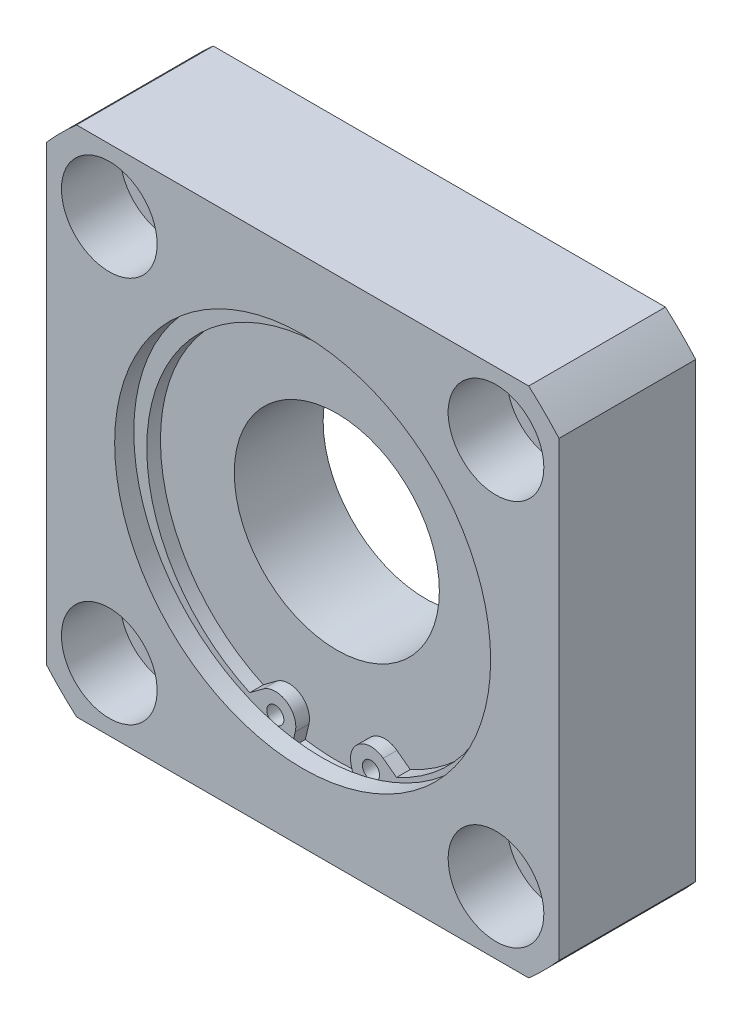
ISO-10303-21;
HEADER;
FILE_DESCRIPTION(('STEP AP214'),'2;1');
FILE_NAME('part.step','',(''),(''),'','','');
FILE_SCHEMA(('AUTOMOTIVE_DESIGN { 1 0 10303 214 1 1 1 1 }'));
ENDSEC;
DATA;
#1=APPLICATION_CONTEXT('core data for automotive mechanical design processes');
#2=APPLICATION_PROTOCOL_DEFINITION('international standard','automotive_design',2000,#1);
#3=PRODUCT_CONTEXT('',#1,'mechanical');
#4=PRODUCT('Part','Part','',(#3));
#5=PRODUCT_RELATED_PRODUCT_CATEGORY('part','',(#4));
#6=PRODUCT_DEFINITION_FORMATION('','',#4);
#7=PRODUCT_DEFINITION_CONTEXT('part definition',#1,'design');
#8=PRODUCT_DEFINITION('design','',#6,#7);
#9=PRODUCT_DEFINITION_SHAPE('','',#8);
#10=(LENGTH_UNIT() NAMED_UNIT(*) SI_UNIT(.MILLI.,.METRE.));
#11=(NAMED_UNIT(*) PLANE_ANGLE_UNIT() SI_UNIT($,.RADIAN.));
#12=(NAMED_UNIT(*) SI_UNIT($,.STERADIAN.) SOLID_ANGLE_UNIT());
#13=UNCERTAINTY_MEASURE_WITH_UNIT(LENGTH_MEASURE(1.E-05),#10,'distance_accuracy_value','');
#14=(GEOMETRIC_REPRESENTATION_CONTEXT(3) GLOBAL_UNCERTAINTY_ASSIGNED_CONTEXT((#13)) GLOBAL_UNIT_ASSIGNED_CONTEXT((#10,
#11,#12)) REPRESENTATION_CONTEXT('',''));
#15=CARTESIAN_POINT('',(0.,0.,0.));
#16=DIRECTION('',(0.,0.,1.));
#17=DIRECTION('',(1.,0.,0.));
#18=AXIS2_PLACEMENT_3D('',#15,#16,#17);
#19=CARTESIAN_POINT('',(0.,0.,15.));
#20=DIRECTION('',(0.,0.,1.));
#21=DIRECTION('',(1.,0.,0.));
#22=AXIS2_PLACEMENT_3D('',#19,#20,#21);
#23=PLANE('',#22);
#24=CARTESIAN_POINT('',(7.,-25.7166112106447,15.));
#25=DIRECTION('',(0.,0.,1.));
#26=DIRECTION('',(1.,0.,0.));
#27=AXIS2_PLACEMENT_3D('',#24,#25,#26);
#28=CIRCLE('',#27,1.25);
#29=CARTESIAN_POINT('',(8.25,-25.7166112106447,15.));
#30=VERTEX_POINT('',#29);
#31=EDGE_CURVE('E449',#30,#30,#28,.T.);
#32=ORIENTED_EDGE('',*,*,#31,.T.);
#33=EDGE_LOOP('',(#32));
#34=FACE_BOUND('',#33,.T.);
#35=ADVANCED_FACE('F14',(#34),#23,.T.);
#36=CARTESIAN_POINT('',(-7.,-25.7166112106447,15.));
#37=DIRECTION('',(0.,0.,-1.));
#38=DIRECTION('',(1.,0.,0.));
#39=AXIS2_PLACEMENT_3D('',#36,#37,#38);
#40=CIRCLE('',#39,1.25);
#41=CARTESIAN_POINT('',(-5.75,-25.7166112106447,15.));
#42=VERTEX_POINT('',#41);
#43=EDGE_CURVE('E193',#42,#42,#40,.T.);
#44=ORIENTED_EDGE('',*,*,#43,.F.);
#45=EDGE_LOOP('',(#44));
#46=FACE_BOUND('',#45,.T.);
#47=ADVANCED_FACE('F378',(#46),#23,.T.);
#48=CARTESIAN_POINT('',(28.2842712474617,28.2842712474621,11.4));
#49=DIRECTION('',(0.,0.,1.));
#50=DIRECTION('',(1.,0.,0.));
#51=AXIS2_PLACEMENT_3D('',#48,#49,#50);
#52=PLANE('',#51);
#53=CARTESIAN_POINT('',(28.2842712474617,28.2842712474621,11.4));
#54=DIRECTION('',(0.,0.,1.));
#55=DIRECTION('',(1.,0.,0.));
#56=AXIS2_PLACEMENT_3D('',#53,#54,#55);
#57=CIRCLE('',#56,7.);
#58=CARTESIAN_POINT('',(35.2842712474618,28.2842712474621,11.4));
#59=VERTEX_POINT('',#58);
#60=EDGE_CURVE('E275',#59,#59,#57,.T.);
#61=ORIENTED_EDGE('',*,*,#60,.T.);
#62=EDGE_LOOP('',(#61));
#63=FACE_BOUND('',#62,.T.);
#64=CARTESIAN_POINT('',(28.2842712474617,28.2842712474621,11.4));
#65=DIRECTION('',(0.,0.,1.));
#66=DIRECTION('',(1.,0.,0.));
#67=AXIS2_PLACEMENT_3D('',#64,#65,#66);
#68=CIRCLE('',#67,5.);
#69=CARTESIAN_POINT('',(33.2842712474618,28.2842712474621,11.4));
#70=VERTEX_POINT('',#69);
#71=EDGE_CURVE('E278',#70,#70,#68,.F.);
#72=ORIENTED_EDGE('',*,*,#71,.T.);
#73=EDGE_LOOP('',(#72));
#74=FACE_BOUND('',#73,.T.);
#75=ADVANCED_FACE('F386',(#63,#74),#52,.T.);
#76=CARTESIAN_POINT('',(28.2842712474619,-28.2842712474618,11.4));
#77=DIRECTION('',(0.,0.,1.));
#78=DIRECTION('',(0.,-1.,0.));
#79=AXIS2_PLACEMENT_3D('',#76,#77,#78);
#80=PLANE('',#79);
#81=CARTESIAN_POINT('',(28.2842712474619,-28.2842712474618,11.4));
#82=DIRECTION('',(0.,0.,1.));
#83=DIRECTION('',(0.,-1.,0.));
#84=AXIS2_PLACEMENT_3D('',#81,#82,#83);
#85=CIRCLE('',#84,7.);
#86=CARTESIAN_POINT('',(28.2842712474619,-35.2842712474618,11.4));
#87=VERTEX_POINT('',#86);
#88=EDGE_CURVE('E259',#87,#87,#85,.T.);
#89=ORIENTED_EDGE('',*,*,#88,.T.);
#90=EDGE_LOOP('',(#89));
#91=FACE_BOUND('',#90,.T.);
#92=CARTESIAN_POINT('',(28.2842712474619,-28.2842712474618,11.4));
#93=DIRECTION('',(0.,0.,1.));
#94=DIRECTION('',(1.,0.,0.));
#95=AXIS2_PLACEMENT_3D('',#92,#93,#94);
#96=CIRCLE('',#95,5.);
#97=CARTESIAN_POINT('',(33.284271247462,-28.2842712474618,11.4));
#98=VERTEX_POINT('',#97);
#99=EDGE_CURVE('E262',#98,#98,#96,.F.);
#100=ORIENTED_EDGE('',*,*,#99,.T.);
#101=EDGE_LOOP('',(#100));
#102=FACE_BOUND('',#101,.T.);
#103=ADVANCED_FACE('F810',(#91,#102),#80,.T.);
#104=CARTESIAN_POINT('',(-28.2842712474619,-28.2842712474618,11.4));
#105=DIRECTION('',(0.,0.,1.));
#106=DIRECTION('',(-1.,0.,0.));
#107=AXIS2_PLACEMENT_3D('',#104,#105,#106);
#108=PLANE('',#107);
#109=CARTESIAN_POINT('',(-28.2842712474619,-28.2842712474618,11.4));
#110=DIRECTION('',(0.,0.,1.));
#111=DIRECTION('',(-1.,0.,0.));
#112=AXIS2_PLACEMENT_3D('',#109,#110,#111);
#113=CIRCLE('',#112,7.);
#114=CARTESIAN_POINT('',(-35.284271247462,-28.2842712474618,11.4));
#115=VERTEX_POINT('',#114);
#116=EDGE_CURVE('E252',#115,#115,#113,.T.);
#117=ORIENTED_EDGE('',*,*,#116,.T.);
#118=EDGE_LOOP('',(#117));
#119=FACE_BOUND('',#118,.T.);
#120=CARTESIAN_POINT('',(-28.2842712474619,-28.2842712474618,11.4));
#121=DIRECTION('',(0.,0.,1.));
#122=DIRECTION('',(1.,0.,0.));
#123=AXIS2_PLACEMENT_3D('',#120,#121,#122);
#124=CIRCLE('',#123,5.);
#125=CARTESIAN_POINT('',(-23.2842712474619,-28.2842712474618,11.4));
#126=VERTEX_POINT('',#125);
#127=EDGE_CURVE('E255',#126,#126,#124,.F.);
#128=ORIENTED_EDGE('',*,*,#127,.T.);
#129=EDGE_LOOP('',(#128));
#130=FACE_BOUND('',#129,.T.);
#131=ADVANCED_FACE('F800',(#119,#130),#108,.T.);
#132=CARTESIAN_POINT('',(-28.2842712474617,28.2842712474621,11.4));
#133=DIRECTION('',(0.,0.,1.));
#134=DIRECTION('',(0.,1.,0.));
#135=AXIS2_PLACEMENT_3D('',#132,#133,#134);
#136=PLANE('',#135);
#137=CARTESIAN_POINT('',(-28.2842712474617,28.2842712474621,11.4));
#138=DIRECTION('',(0.,0.,1.));
#139=DIRECTION('',(0.,1.,0.));
#140=AXIS2_PLACEMENT_3D('',#137,#138,#139);
#141=CIRCLE('',#140,7.);
#142=CARTESIAN_POINT('',(-28.2842712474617,35.2842712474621,11.4));
#143=VERTEX_POINT('',#142);
#144=EDGE_CURVE('E245',#143,#143,#141,.T.);
#145=ORIENTED_EDGE('',*,*,#144,.T.);
#146=EDGE_LOOP('',(#145));
#147=FACE_BOUND('',#146,.T.);
#148=CARTESIAN_POINT('',(-28.2842712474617,28.2842712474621,11.4));
#149=DIRECTION('',(0.,0.,1.));
#150=DIRECTION('',(1.,0.,0.));
#151=AXIS2_PLACEMENT_3D('',#148,#149,#150);
#152=CIRCLE('',#151,5.);
#153=CARTESIAN_POINT('',(-23.2842712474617,28.2842712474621,11.4));
#154=VERTEX_POINT('',#153);
#155=EDGE_CURVE('E248',#154,#154,#152,.F.);
#156=ORIENTED_EDGE('',*,*,#155,.T.);
#157=EDGE_LOOP('',(#156));
#158=FACE_BOUND('',#157,.T.);
#159=ADVANCED_FACE('F790',(#147,#158),#136,.T.);
#160=CARTESIAN_POINT('',(28.2842712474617,28.2842712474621,0.));
#161=DIRECTION('',(0.,0.,1.));
#162=DIRECTION('',(1.,0.,0.));
#163=AXIS2_PLACEMENT_3D('',#160,#161,#162);
#164=CYLINDRICAL_SURFACE('',#163,5.);
#165=CARTESIAN_POINT('',(28.2842712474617,28.2842712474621,0.));
#166=DIRECTION('',(0.,0.,1.));
#167=DIRECTION('',(1.,0.,0.));
#168=AXIS2_PLACEMENT_3D('',#165,#166,#167);
#169=CIRCLE('',#168,5.);
#170=CARTESIAN_POINT('',(33.2842712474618,28.2842712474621,0.));
#171=VERTEX_POINT('',#170);
#172=EDGE_CURVE('E279',#171,#171,#169,.T.);
#173=ORIENTED_EDGE('',*,*,#172,.F.);
#174=EDGE_LOOP('',(#173));
#175=FACE_BOUND('',#174,.T.);
#176=ORIENTED_EDGE('',*,*,#71,.F.);
#177=EDGE_LOOP('',(#176));
#178=FACE_BOUND('',#177,.T.);
#179=ADVANCED_FACE('F780',(#175,#178),#164,.F.);
#180=CARTESIAN_POINT('',(28.2842712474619,-28.2842712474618,0.));
#181=DIRECTION('',(0.,0.,1.));
#182=DIRECTION('',(1.,0.,0.));
#183=AXIS2_PLACEMENT_3D('',#180,#181,#182);
#184=CYLINDRICAL_SURFACE('',#183,5.);
#185=CARTESIAN_POINT('',(28.2842712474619,-28.2842712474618,0.));
#186=DIRECTION('',(0.,0.,1.));
#187=DIRECTION('',(0.,-1.,0.));
#188=AXIS2_PLACEMENT_3D('',#185,#186,#187);
#189=CIRCLE('',#188,5.);
#190=CARTESIAN_POINT('',(28.2842712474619,-33.2842712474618,0.));
#191=VERTEX_POINT('',#190);
#192=EDGE_CURVE('E269',#191,#191,#189,.T.);
#193=ORIENTED_EDGE('',*,*,#192,.F.);
#194=EDGE_LOOP('',(#193));
#195=FACE_BOUND('',#194,.T.);
#196=ORIENTED_EDGE('',*,*,#99,.F.);
#197=EDGE_LOOP('',(#196));
#198=FACE_BOUND('',#197,.T.);
#199=ADVANCED_FACE('F770',(#195,#198),#184,.F.);
#200=CARTESIAN_POINT('',(-28.2842712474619,-28.2842712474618,0.));
#201=DIRECTION('',(0.,0.,1.));
#202=DIRECTION('',(1.,0.,0.));
#203=AXIS2_PLACEMENT_3D('',#200,#201,#202);
#204=CYLINDRICAL_SURFACE('',#203,5.);
#205=CARTESIAN_POINT('',(-28.2842712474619,-28.2842712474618,0.));
#206=DIRECTION('',(0.,0.,1.));
#207=DIRECTION('',(-1.,0.,0.));
#208=AXIS2_PLACEMENT_3D('',#205,#206,#207);
#209=CIRCLE('',#208,5.);
#210=CARTESIAN_POINT('',(-33.284271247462,-28.2842712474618,0.));
#211=VERTEX_POINT('',#210);
#212=EDGE_CURVE('E266',#211,#211,#209,.T.);
#213=ORIENTED_EDGE('',*,*,#212,.F.);
#214=EDGE_LOOP('',(#213));
#215=FACE_BOUND('',#214,.T.);
#216=ORIENTED_EDGE('',*,*,#127,.F.);
#217=EDGE_LOOP('',(#216));
#218=FACE_BOUND('',#217,.T.);
#219=ADVANCED_FACE('F760',(#215,#218),#204,.F.);
#220=CARTESIAN_POINT('',(-28.2842712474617,28.2842712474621,0.));
#221=DIRECTION('',(0.,0.,1.));
#222=DIRECTION('',(1.,0.,0.));
#223=AXIS2_PLACEMENT_3D('',#220,#221,#222);
#224=CYLINDRICAL_SURFACE('',#223,5.);
#225=CARTESIAN_POINT('',(-28.2842712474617,28.2842712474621,0.));
#226=DIRECTION('',(0.,0.,1.));
#227=DIRECTION('',(0.,1.,0.));
#228=AXIS2_PLACEMENT_3D('',#225,#226,#227);
#229=CIRCLE('',#228,5.);
#230=CARTESIAN_POINT('',(-28.2842712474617,33.2842712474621,0.));
#231=VERTEX_POINT('',#230);
#232=EDGE_CURVE('E263',#231,#231,#229,.T.);
#233=ORIENTED_EDGE('',*,*,#232,.F.);
#234=EDGE_LOOP('',(#233));
#235=FACE_BOUND('',#234,.T.);
#236=ORIENTED_EDGE('',*,*,#155,.F.);
#237=EDGE_LOOP('',(#236));
#238=FACE_BOUND('',#237,.T.);
#239=ADVANCED_FACE('F750',(#235,#238),#224,.F.);
#240=CARTESIAN_POINT('',(-33.0718913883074,-37.5,20.));
#241=DIRECTION('',(0.,1.,0.));
#242=DIRECTION('',(0.,0.,1.));
#243=AXIS2_PLACEMENT_3D('',#240,#241,#242);
#244=PLANE('',#243);
#245=DIRECTION('',(1.,0.,0.));
#246=VECTOR('',#245,1.);
#247=CARTESIAN_POINT('',(-33.0718913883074,-37.5,20.));
#248=LINE('',#247,#246);
#249=CARTESIAN_POINT('',(-33.0718913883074,-37.5,20.));
#250=VERTEX_POINT('',#249);
#251=CARTESIAN_POINT('',(33.0718913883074,-37.5,20.));
#252=VERTEX_POINT('',#251);
#253=EDGE_CURVE('E307',#250,#252,#248,.T.);
#254=ORIENTED_EDGE('',*,*,#253,.F.);
#255=DIRECTION('',(0.,0.,-1.));
#256=VECTOR('',#255,1.);
#257=CARTESIAN_POINT('',(-33.0718913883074,-37.5,20.));
#258=LINE('',#257,#256);
#259=CARTESIAN_POINT('',(-33.0718913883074,-37.5,0.));
#260=VERTEX_POINT('',#259);
#261=EDGE_CURVE('E330',#250,#260,#258,.T.);
#262=ORIENTED_EDGE('',*,*,#261,.T.);
#263=DIRECTION('',(1.,0.,0.));
#264=VECTOR('',#263,1.);
#265=CARTESIAN_POINT('',(-33.0718913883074,-37.5,0.));
#266=LINE('',#265,#264);
#267=CARTESIAN_POINT('',(33.0718913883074,-37.5,0.));
#268=VERTEX_POINT('',#267);
#269=EDGE_CURVE('E285',#260,#268,#266,.T.);
#270=ORIENTED_EDGE('',*,*,#269,.T.);
#271=DIRECTION('',(0.,0.,-1.));
#272=VECTOR('',#271,1.);
#273=CARTESIAN_POINT('',(33.0718913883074,-37.5,20.));
#274=LINE('',#273,#272);
#275=EDGE_CURVE('E328',#252,#268,#274,.T.);
#276=ORIENTED_EDGE('',*,*,#275,.F.);
#277=EDGE_LOOP('',(#254,#262,#270,#276));
#278=FACE_BOUND('',#277,.T.);
#279=ADVANCED_FACE('F740',(#278),#244,.F.);
#280=CARTESIAN_POINT('',(0.,0.,20.));
#281=DIRECTION('',(0.,0.,-1.));
#282=DIRECTION('',(-1.,0.,0.));
#283=AXIS2_PLACEMENT_3D('',#280,#281,#282);
#284=CYLINDRICAL_SURFACE('',#283,50.);
#285=ORIENTED_EDGE('',*,*,#261,.F.);
#286=CARTESIAN_POINT('',(0.,0.,20.));
#287=DIRECTION('',(0.,0.,1.));
#288=DIRECTION('',(1.,0.,0.));
#289=AXIS2_PLACEMENT_3D('',#286,#287,#288);
#290=CIRCLE('',#289,50.);
#291=CARTESIAN_POINT('',(-37.5,-33.0718913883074,20.));
#292=VERTEX_POINT('',#291);
#293=EDGE_CURVE('E310',#292,#250,#290,.T.);
#294=ORIENTED_EDGE('',*,*,#293,.F.);
#295=DIRECTION('',(0.,0.,-1.));
#296=VECTOR('',#295,1.);
#297=CARTESIAN_POINT('',(-37.5,-33.0718913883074,20.));
#298=LINE('',#297,#296);
#299=CARTESIAN_POINT('',(-37.5,-33.0718913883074,0.));
#300=VERTEX_POINT('',#299);
#301=EDGE_CURVE('E332',#292,#300,#298,.T.);
#302=ORIENTED_EDGE('',*,*,#301,.T.);
#303=CARTESIAN_POINT('',(0.,0.,0.));
#304=DIRECTION('',(0.,0.,1.));
#305=DIRECTION('',(1.,0.,0.));
#306=AXIS2_PLACEMENT_3D('',#303,#304,#305);
#307=CIRCLE('',#306,50.);
#308=EDGE_CURVE('E288',#300,#260,#307,.T.);
#309=ORIENTED_EDGE('',*,*,#308,.T.);
#310=EDGE_LOOP('',(#285,#294,#302,#309));
#311=FACE_BOUND('',#310,.T.);
#312=ADVANCED_FACE('F730',(#311),#284,.T.);
#313=CARTESIAN_POINT('',(-37.5,-33.0718913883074,20.));
#314=DIRECTION('',(-1.,0.,0.));
#315=DIRECTION('',(0.,0.,1.));
#316=AXIS2_PLACEMENT_3D('',#313,#314,#315);
#317=PLANE('',#316);
#318=ORIENTED_EDGE('',*,*,#301,.F.);
#319=DIRECTION('',(0.,1.,0.));
#320=VECTOR('',#319,1.);
#321=CARTESIAN_POINT('',(-37.5,-33.0718913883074,20.));
#322=LINE('',#321,#320);
#323=CARTESIAN_POINT('',(-37.5,33.0718913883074,20.));
#324=VERTEX_POINT('',#323);
#325=EDGE_CURVE('E313',#292,#324,#322,.T.);
#326=ORIENTED_EDGE('',*,*,#325,.T.);
#327=DIRECTION('',(0.,0.,-1.));
#328=VECTOR('',#327,1.);
#329=CARTESIAN_POINT('',(-37.5,33.0718913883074,20.));
#330=LINE('',#329,#328);
#331=CARTESIAN_POINT('',(-37.5,33.0718913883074,0.));
#332=VERTEX_POINT('',#331);
#333=EDGE_CURVE('E334',#324,#332,#330,.T.);
#334=ORIENTED_EDGE('',*,*,#333,.T.);
#335=DIRECTION('',(0.,1.,0.));
#336=VECTOR('',#335,1.);
#337=CARTESIAN_POINT('',(-37.5,-33.0718913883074,0.));
#338=LINE('',#337,#336);
#339=EDGE_CURVE('E291',#300,#332,#338,.T.);
#340=ORIENTED_EDGE('',*,*,#339,.F.);
#341=EDGE_LOOP('',(#318,#326,#334,#340));
#342=FACE_BOUND('',#341,.T.);
#343=ADVANCED_FACE('F720',(#342),#317,.T.);
#344=CARTESIAN_POINT('',(0.,0.,20.));
#345=DIRECTION('',(0.,0.,-1.));
#346=DIRECTION('',(-1.,0.,0.));
#347=AXIS2_PLACEMENT_3D('',#344,#345,#346);
#348=CYLINDRICAL_SURFACE('',#347,50.);
#349=ORIENTED_EDGE('',*,*,#333,.F.);
#350=CARTESIAN_POINT('',(0.,0.,20.));
#351=DIRECTION('',(0.,0.,-1.));
#352=DIRECTION('',(-1.,0.,0.));
#353=AXIS2_PLACEMENT_3D('',#350,#351,#352);
#354=CIRCLE('',#353,50.);
#355=CARTESIAN_POINT('',(-33.0718913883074,37.5,20.));
#356=VERTEX_POINT('',#355);
#357=EDGE_CURVE('E316',#324,#356,#354,.T.);
#358=ORIENTED_EDGE('',*,*,#357,.T.);
#359=DIRECTION('',(0.,0.,-1.));
#360=VECTOR('',#359,1.);
#361=CARTESIAN_POINT('',(-33.0718913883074,37.5,20.));
#362=LINE('',#361,#360);
#363=CARTESIAN_POINT('',(-33.0718913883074,37.5,0.));
#364=VERTEX_POINT('',#363);
#365=EDGE_CURVE('E336',#356,#364,#362,.T.);
#366=ORIENTED_EDGE('',*,*,#365,.T.);
#367=CARTESIAN_POINT('',(0.,0.,0.));
#368=DIRECTION('',(0.,0.,-1.));
#369=DIRECTION('',(-1.,0.,0.));
#370=AXIS2_PLACEMENT_3D('',#367,#368,#369);
#371=CIRCLE('',#370,50.);
#372=EDGE_CURVE('E294',#332,#364,#371,.T.);
#373=ORIENTED_EDGE('',*,*,#372,.F.);
#374=EDGE_LOOP('',(#349,#358,#366,#373));
#375=FACE_BOUND('',#374,.T.);
#376=ADVANCED_FACE('F710',(#375),#348,.T.);
#377=CARTESIAN_POINT('',(-33.0718913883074,37.5,20.));
#378=DIRECTION('',(0.,1.,0.));
#379=DIRECTION('',(0.,0.,1.));
#380=AXIS2_PLACEMENT_3D('',#377,#378,#379);
#381=PLANE('',#380);
#382=ORIENTED_EDGE('',*,*,#365,.F.);
#383=DIRECTION('',(1.,0.,0.));
#384=VECTOR('',#383,1.);
#385=CARTESIAN_POINT('',(-33.0718913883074,37.5,20.));
#386=LINE('',#385,#384);
#387=CARTESIAN_POINT('',(33.0718913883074,37.5,20.));
#388=VERTEX_POINT('',#387);
#389=EDGE_CURVE('E319',#356,#388,#386,.T.);
#390=ORIENTED_EDGE('',*,*,#389,.T.);
#391=DIRECTION('',(0.,0.,-1.));
#392=VECTOR('',#391,1.);
#393=CARTESIAN_POINT('',(33.0718913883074,37.5,20.));
#394=LINE('',#393,#392);
#395=CARTESIAN_POINT('',(33.0718913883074,37.5,0.));
#396=VERTEX_POINT('',#395);
#397=EDGE_CURVE('E338',#388,#396,#394,.T.);
#398=ORIENTED_EDGE('',*,*,#397,.T.);
#399=DIRECTION('',(1.,0.,0.));
#400=VECTOR('',#399,1.);
#401=CARTESIAN_POINT('',(-33.0718913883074,37.5,0.));
#402=LINE('',#401,#400);
#403=EDGE_CURVE('E297',#364,#396,#402,.T.);
#404=ORIENTED_EDGE('',*,*,#403,.F.);
#405=EDGE_LOOP('',(#382,#390,#398,#404));
#406=FACE_BOUND('',#405,.T.);
#407=ADVANCED_FACE('F701',(#406),#381,.T.);
#408=CARTESIAN_POINT('',(0.,0.,20.));
#409=DIRECTION('',(0.,0.,-1.));
#410=DIRECTION('',(-1.,0.,0.));
#411=AXIS2_PLACEMENT_3D('',#408,#409,#410);
#412=CYLINDRICAL_SURFACE('',#411,50.);
#413=ORIENTED_EDGE('',*,*,#397,.F.);
#414=CARTESIAN_POINT('',(0.,0.,20.));
#415=DIRECTION('',(0.,0.,1.));
#416=DIRECTION('',(1.,0.,0.));
#417=AXIS2_PLACEMENT_3D('',#414,#415,#416);
#418=CIRCLE('',#417,50.);
#419=CARTESIAN_POINT('',(37.5,33.0718913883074,20.));
#420=VERTEX_POINT('',#419);
#421=EDGE_CURVE('E322',#420,#388,#418,.T.);
#422=ORIENTED_EDGE('',*,*,#421,.F.);
#423=DIRECTION('',(0.,0.,-1.));
#424=VECTOR('',#423,1.);
#425=CARTESIAN_POINT('',(37.5,33.0718913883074,20.));
#426=LINE('',#425,#424);
#427=CARTESIAN_POINT('',(37.5,33.0718913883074,0.));
#428=VERTEX_POINT('',#427);
#429=EDGE_CURVE('E82',#420,#428,#426,.T.);
#430=ORIENTED_EDGE('',*,*,#429,.T.);
#431=CARTESIAN_POINT('',(0.,0.,0.));
#432=DIRECTION('',(0.,0.,1.));
#433=DIRECTION('',(1.,0.,0.));
#434=AXIS2_PLACEMENT_3D('',#431,#432,#433);
#435=CIRCLE('',#434,50.);
#436=EDGE_CURVE('E300',#428,#396,#435,.T.);
#437=ORIENTED_EDGE('',*,*,#436,.T.);
#438=EDGE_LOOP('',(#413,#422,#430,#437));
#439=FACE_BOUND('',#438,.T.);
#440=ADVANCED_FACE('F693',(#439),#412,.T.);
#441=CARTESIAN_POINT('',(37.5,-33.0718913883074,20.));
#442=DIRECTION('',(-1.,0.,0.));
#443=DIRECTION('',(0.,0.,1.));
#444=AXIS2_PLACEMENT_3D('',#441,#442,#443);
#445=PLANE('',#444);
#446=ORIENTED_EDGE('',*,*,#429,.F.);
#447=DIRECTION('',(0.,1.,0.));
#448=VECTOR('',#447,1.);
#449=CARTESIAN_POINT('',(37.5,-33.0718913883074,20.));
#450=LINE('',#449,#448);
#451=CARTESIAN_POINT('',(37.5,-33.0718913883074,20.));
#452=VERTEX_POINT('',#451);
#453=EDGE_CURVE('E325',#452,#420,#450,.T.);
#454=ORIENTED_EDGE('',*,*,#453,.F.);
#455=DIRECTION('',(0.,0.,-1.));
#456=VECTOR('',#455,1.);
#457=CARTESIAN_POINT('',(37.5,-33.0718913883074,20.));
#458=LINE('',#457,#456);
#459=CARTESIAN_POINT('',(37.5,-33.0718913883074,0.));
#460=VERTEX_POINT('',#459);
#461=EDGE_CURVE('E89',#452,#460,#458,.T.);
#462=ORIENTED_EDGE('',*,*,#461,.T.);
#463=DIRECTION('',(0.,1.,0.));
#464=VECTOR('',#463,1.);
#465=CARTESIAN_POINT('',(37.5,-33.0718913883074,0.));
#466=LINE('',#465,#464);
#467=EDGE_CURVE('E303',#460,#428,#466,.T.);
#468=ORIENTED_EDGE('',*,*,#467,.T.);
#469=EDGE_LOOP('',(#446,#454,#462,#468));
#470=FACE_BOUND('',#469,.T.);
#471=ADVANCED_FACE('F16',(#470),#445,.F.);
#472=CARTESIAN_POINT('',(0.,0.,20.));
#473=DIRECTION('',(0.,0.,-1.));
#474=DIRECTION('',(-1.,0.,0.));
#475=AXIS2_PLACEMENT_3D('',#472,#473,#474);
#476=CYLINDRICAL_SURFACE('',#475,50.);
#477=ORIENTED_EDGE('',*,*,#461,.F.);
#478=CARTESIAN_POINT('',(0.,0.,20.));
#479=DIRECTION('',(0.,0.,-1.));
#480=DIRECTION('',(-1.,0.,0.));
#481=AXIS2_PLACEMENT_3D('',#478,#479,#480);
#482=CIRCLE('',#481,50.);
#483=EDGE_CURVE('E305',#452,#252,#482,.T.);
#484=ORIENTED_EDGE('',*,*,#483,.T.);
#485=ORIENTED_EDGE('',*,*,#275,.T.);
#486=CARTESIAN_POINT('',(0.,0.,0.));
#487=DIRECTION('',(0.,0.,-1.));
#488=DIRECTION('',(-1.,0.,0.));
#489=AXIS2_PLACEMENT_3D('',#486,#487,#488);
#490=CIRCLE('',#489,50.);
#491=EDGE_CURVE('E282',#460,#268,#490,.T.);
#492=ORIENTED_EDGE('',*,*,#491,.F.);
#493=EDGE_LOOP('',(#477,#484,#485,#492));
#494=FACE_BOUND('',#493,.T.);
#495=ADVANCED_FACE('F675',(#494),#476,.T.);
#496=CARTESIAN_POINT('',(28.2842712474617,28.2842712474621,11.4));
#497=DIRECTION('',(0.,0.,1.));
#498=DIRECTION('',(1.,0.,0.));
#499=AXIS2_PLACEMENT_3D('',#496,#497,#498);
#500=CYLINDRICAL_SURFACE('',#499,7.);
#501=ORIENTED_EDGE('',*,*,#60,.F.);
#502=EDGE_LOOP('',(#501));
#503=FACE_BOUND('',#502,.T.);
#504=CARTESIAN_POINT('',(28.2842712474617,28.2842712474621,20.));
#505=DIRECTION('',(0.,0.,1.));
#506=DIRECTION('',(1.,0.,0.));
#507=AXIS2_PLACEMENT_3D('',#504,#505,#506);
#508=CIRCLE('',#507,7.);
#509=CARTESIAN_POINT('',(35.2842712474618,28.2842712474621,20.));
#510=VERTEX_POINT('',#509);
#511=EDGE_CURVE('E272',#510,#510,#508,.T.);
#512=ORIENTED_EDGE('',*,*,#511,.T.);
#513=EDGE_LOOP('',(#512));
#514=FACE_BOUND('',#513,.T.);
#515=ADVANCED_FACE('F665',(#503,#514),#500,.F.);
#516=CARTESIAN_POINT('',(28.2842712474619,-28.2842712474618,11.4));
#517=DIRECTION('',(0.,0.,1.));
#518=DIRECTION('',(1.,0.,0.));
#519=AXIS2_PLACEMENT_3D('',#516,#517,#518);
#520=CYLINDRICAL_SURFACE('',#519,7.);
#521=ORIENTED_EDGE('',*,*,#88,.F.);
#522=EDGE_LOOP('',(#521));
#523=FACE_BOUND('',#522,.T.);
#524=CARTESIAN_POINT('',(28.2842712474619,-28.2842712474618,20.));
#525=DIRECTION('',(0.,0.,1.));
#526=DIRECTION('',(0.,-1.,0.));
#527=AXIS2_PLACEMENT_3D('',#524,#525,#526);
#528=CIRCLE('',#527,7.);
#529=CARTESIAN_POINT('',(28.2842712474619,-35.2842712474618,20.));
#530=VERTEX_POINT('',#529);
#531=EDGE_CURVE('E256',#530,#530,#528,.T.);
#532=ORIENTED_EDGE('',*,*,#531,.T.);
#533=EDGE_LOOP('',(#532));
#534=FACE_BOUND('',#533,.T.);
#535=ADVANCED_FACE('F655',(#523,#534),#520,.F.);
#536=CARTESIAN_POINT('',(-28.2842712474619,-28.2842712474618,11.4));
#537=DIRECTION('',(0.,0.,1.));
#538=DIRECTION('',(1.,0.,0.));
#539=AXIS2_PLACEMENT_3D('',#536,#537,#538);
#540=CYLINDRICAL_SURFACE('',#539,7.);
#541=ORIENTED_EDGE('',*,*,#116,.F.);
#542=EDGE_LOOP('',(#541));
#543=FACE_BOUND('',#542,.T.);
#544=CARTESIAN_POINT('',(-28.2842712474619,-28.2842712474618,20.));
#545=DIRECTION('',(0.,0.,1.));
#546=DIRECTION('',(-1.,0.,0.));
#547=AXIS2_PLACEMENT_3D('',#544,#545,#546);
#548=CIRCLE('',#547,7.);
#549=CARTESIAN_POINT('',(-35.284271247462,-28.2842712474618,20.));
#550=VERTEX_POINT('',#549);
#551=EDGE_CURVE('E249',#550,#550,#548,.T.);
#552=ORIENTED_EDGE('',*,*,#551,.T.);
#553=EDGE_LOOP('',(#552));
#554=FACE_BOUND('',#553,.T.);
#555=ADVANCED_FACE('F645',(#543,#554),#540,.F.);
#556=CARTESIAN_POINT('',(-28.2842712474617,28.2842712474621,11.4));
#557=DIRECTION('',(0.,0.,1.));
#558=DIRECTION('',(1.,0.,0.));
#559=AXIS2_PLACEMENT_3D('',#556,#557,#558);
#560=CYLINDRICAL_SURFACE('',#559,7.);
#561=ORIENTED_EDGE('',*,*,#144,.F.);
#562=EDGE_LOOP('',(#561));
#563=FACE_BOUND('',#562,.T.);
#564=CARTESIAN_POINT('',(-28.2842712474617,28.2842712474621,20.));
#565=DIRECTION('',(0.,0.,1.));
#566=DIRECTION('',(0.,1.,0.));
#567=AXIS2_PLACEMENT_3D('',#564,#565,#566);
#568=CIRCLE('',#567,7.);
#569=CARTESIAN_POINT('',(-28.2842712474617,35.2842712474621,20.));
#570=VERTEX_POINT('',#569);
#571=EDGE_CURVE('E242',#570,#570,#568,.T.);
#572=ORIENTED_EDGE('',*,*,#571,.T.);
#573=EDGE_LOOP('',(#572));
#574=FACE_BOUND('',#573,.T.);
#575=ADVANCED_FACE('F635',(#563,#574),#560,.F.);
#576=CARTESIAN_POINT('',(0.,0.,0.));
#577=DIRECTION('',(0.,0.,-1.));
#578=DIRECTION('',(-1.,0.,0.));
#579=AXIS2_PLACEMENT_3D('',#576,#577,#578);
#580=PLANE('',#579);
#581=CARTESIAN_POINT('',(0.,0.,0.));
#582=DIRECTION('',(0.,0.,-1.));
#583=DIRECTION('',(-1.,0.,0.));
#584=AXIS2_PLACEMENT_3D('',#581,#582,#583);
#585=CIRCLE('',#584,24.);
#586=CARTESIAN_POINT('',(-24.,0.,0.));
#587=VERTEX_POINT('',#586);
#588=EDGE_CURVE('E231',#587,#587,#585,.T.);
#589=ORIENTED_EDGE('',*,*,#588,.F.);
#590=EDGE_LOOP('',(#589));
#591=FACE_BOUND('',#590,.T.);
#592=ORIENTED_EDGE('',*,*,#232,.T.);
#593=EDGE_LOOP('',(#592));
#594=FACE_BOUND('',#593,.T.);
#595=ORIENTED_EDGE('',*,*,#212,.T.);
#596=EDGE_LOOP('',(#595));
#597=FACE_BOUND('',#596,.T.);
#598=ORIENTED_EDGE('',*,*,#192,.T.);
#599=EDGE_LOOP('',(#598));
#600=FACE_BOUND('',#599,.T.);
#601=ORIENTED_EDGE('',*,*,#172,.T.);
#602=EDGE_LOOP('',(#601));
#603=FACE_BOUND('',#602,.T.);
#604=ORIENTED_EDGE('',*,*,#491,.T.);
#605=ORIENTED_EDGE('',*,*,#269,.F.);
#606=ORIENTED_EDGE('',*,*,#308,.F.);
#607=ORIENTED_EDGE('',*,*,#339,.T.);
#608=ORIENTED_EDGE('',*,*,#372,.T.);
#609=ORIENTED_EDGE('',*,*,#403,.T.);
#610=ORIENTED_EDGE('',*,*,#436,.F.);
#611=ORIENTED_EDGE('',*,*,#467,.F.);
#612=EDGE_LOOP('',(#604,#605,#606,#607,#608,#609,#610,#611));
#613=FACE_BOUND('',#612,.T.);
#614=ADVANCED_FACE('F625',(#591,#594,#597,#600,#603,#613),#580,.T.);
#615=CARTESIAN_POINT('',(0.,0.,20.));
#616=DIRECTION('',(0.,0.,-1.));
#617=DIRECTION('',(-1.,0.,0.));
#618=AXIS2_PLACEMENT_3D('',#615,#616,#617);
#619=PLANE('',#618);
#620=CARTESIAN_POINT('',(0.,0.,20.));
#621=DIRECTION('',(0.,0.,1.));
#622=DIRECTION('',(1.,0.,0.));
#623=AXIS2_PLACEMENT_3D('',#620,#621,#622);
#624=CIRCLE('',#623,27.5);
#625=CARTESIAN_POINT('',(27.5,0.,20.));
#626=VERTEX_POINT('',#625);
#627=EDGE_CURVE('E238',#626,#626,#624,.T.);
#628=ORIENTED_EDGE('',*,*,#627,.F.);
#629=EDGE_LOOP('',(#628));
#630=FACE_BOUND('',#629,.T.);
#631=ORIENTED_EDGE('',*,*,#571,.F.);
#632=EDGE_LOOP('',(#631));
#633=FACE_BOUND('',#632,.T.);
#634=ORIENTED_EDGE('',*,*,#551,.F.);
#635=EDGE_LOOP('',(#634));
#636=FACE_BOUND('',#635,.T.);
#637=ORIENTED_EDGE('',*,*,#531,.F.);
#638=EDGE_LOOP('',(#637));
#639=FACE_BOUND('',#638,.T.);
#640=ORIENTED_EDGE('',*,*,#511,.F.);
#641=EDGE_LOOP('',(#640));
#642=FACE_BOUND('',#641,.T.);
#643=ORIENTED_EDGE('',*,*,#483,.F.);
#644=ORIENTED_EDGE('',*,*,#453,.T.);
#645=ORIENTED_EDGE('',*,*,#421,.T.);
#646=ORIENTED_EDGE('',*,*,#389,.F.);
#647=ORIENTED_EDGE('',*,*,#357,.F.);
#648=ORIENTED_EDGE('',*,*,#325,.F.);
#649=ORIENTED_EDGE('',*,*,#293,.T.);
#650=ORIENTED_EDGE('',*,*,#253,.T.);
#651=EDGE_LOOP('',(#643,#644,#645,#646,#647,#648,#649,#650));
#652=FACE_BOUND('',#651,.T.);
#653=ADVANCED_FACE('F616',(#630,#633,#636,#639,#642,#652),#619,.F.);
#654=CARTESIAN_POINT('',(0.,0.,2.));
#655=DIRECTION('',(0.,0.,-1.));
#656=DIRECTION('',(-1.,0.,0.));
#657=AXIS2_PLACEMENT_3D('',#654,#655,#656);
#658=CYLINDRICAL_SURFACE('',#657,24.);
#659=CARTESIAN_POINT('',(0.,0.,2.));
#660=DIRECTION('',(0.,0.,-1.));
#661=DIRECTION('',(-1.,0.,0.));
#662=AXIS2_PLACEMENT_3D('',#659,#660,#661);
#663=CIRCLE('',#662,24.);
#664=CARTESIAN_POINT('',(-24.,0.,2.));
#665=VERTEX_POINT('',#664);
#666=EDGE_CURVE('E234',#665,#665,#663,.T.);
#667=ORIENTED_EDGE('',*,*,#666,.F.);
#668=EDGE_LOOP('',(#667));
#669=FACE_BOUND('',#668,.T.);
#670=ORIENTED_EDGE('',*,*,#588,.T.);
#671=EDGE_LOOP('',(#670));
#672=FACE_BOUND('',#671,.T.);
#673=ADVANCED_FACE('F608',(#669,#672),#658,.F.);
#674=CARTESIAN_POINT('',(0.,0.,15.));
#675=DIRECTION('',(0.,0.,1.));
#676=DIRECTION('',(1.,0.,0.));
#677=AXIS2_PLACEMENT_3D('',#674,#675,#676);
#678=CYLINDRICAL_SURFACE('',#677,27.5);
#679=CARTESIAN_POINT('',(0.,0.,17.2));
#680=DIRECTION('',(0.,0.,1.));
#681=DIRECTION('',(1.,0.,0.));
#682=AXIS2_PLACEMENT_3D('',#679,#680,#681);
#683=CIRCLE('',#682,27.5);
#684=CARTESIAN_POINT('',(27.5,0.,17.2));
#685=VERTEX_POINT('',#684);
#686=EDGE_CURVE('E229',#685,#685,#683,.F.);
#687=ORIENTED_EDGE('',*,*,#686,.T.);
#688=EDGE_LOOP('',(#687));
#689=FACE_BOUND('',#688,.T.);
#690=ORIENTED_EDGE('',*,*,#627,.T.);
#691=EDGE_LOOP('',(#690));
#692=FACE_BOUND('',#691,.T.);
#693=ADVANCED_FACE('F357',(#689,#692),#678,.F.);
#694=CARTESIAN_POINT('',(0.,0.,2.));
#695=DIRECTION('',(0.,0.,-1.));
#696=DIRECTION('',(-1.,0.,0.));
#697=AXIS2_PLACEMENT_3D('',#694,#695,#696);
#698=PLANE('',#697);
#699=CARTESIAN_POINT('',(0.,0.,2.));
#700=DIRECTION('',(0.,0.,-1.));
#701=DIRECTION('',(-1.,0.,0.));
#702=AXIS2_PLACEMENT_3D('',#699,#700,#701);
#703=CIRCLE('',#702,15.);
#704=CARTESIAN_POINT('',(-15.,0.,2.));
#705=VERTEX_POINT('',#704);
#706=EDGE_CURVE('E237',#705,#705,#703,.T.);
#707=ORIENTED_EDGE('',*,*,#706,.F.);
#708=EDGE_LOOP('',(#707));
#709=FACE_BOUND('',#708,.T.);
#710=ORIENTED_EDGE('',*,*,#666,.T.);
#711=EDGE_LOOP('',(#710));
#712=FACE_BOUND('',#711,.T.);
#713=ADVANCED_FACE('F362',(#709,#712),#698,.T.);
#714=CARTESIAN_POINT('',(0.,0.,17.2));
#715=DIRECTION('',(0.,0.,1.));
#716=DIRECTION('',(1.,0.,0.));
#717=AXIS2_PLACEMENT_3D('',#714,#715,#716);
#718=PLANE('',#717);
#719=CARTESIAN_POINT('',(0.,0.,17.2));
#720=DIRECTION('',(0.,0.,1.));
#721=DIRECTION('',(1.,0.,0.));
#722=AXIS2_PLACEMENT_3D('',#719,#720,#721);
#723=CIRCLE('',#722,29.);
#724=CARTESIAN_POINT('',(29.,0.,17.2));
#725=VERTEX_POINT('',#724);
#726=EDGE_CURVE('E226',#725,#725,#723,.T.);
#727=ORIENTED_EDGE('',*,*,#726,.F.);
#728=EDGE_LOOP('',(#727));
#729=FACE_BOUND('',#728,.T.);
#730=ORIENTED_EDGE('',*,*,#686,.F.);
#731=EDGE_LOOP('',(#730));
#732=FACE_BOUND('',#731,.T.);
#733=ADVANCED_FACE('F360',(#729,#732),#718,.F.);
#734=CARTESIAN_POINT('',(0.,0.,17.2));
#735=DIRECTION('',(0.,0.,-1.));
#736=DIRECTION('',(-1.,0.,0.));
#737=AXIS2_PLACEMENT_3D('',#734,#735,#736);
#738=CYLINDRICAL_SURFACE('',#737,29.);
#739=ORIENTED_EDGE('',*,*,#726,.T.);
#740=EDGE_LOOP('',(#739));
#741=FACE_BOUND('',#740,.T.);
#742=DIRECTION('',(0.,0.,-1.));
#743=VECTOR('',#742,1.);
#744=CARTESIAN_POINT('',(4.60946385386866,-28.6313262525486,17.2));
#745=LINE('',#744,#743);
#746=CARTESIAN_POINT('',(4.60946385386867,-28.6313262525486,15.));
#747=VERTEX_POINT('',#746);
#748=CARTESIAN_POINT('',(4.60946385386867,-28.6313262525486,17.));
#749=VERTEX_POINT('',#748);
#750=EDGE_CURVE('E18',#747,#749,#745,.F.);
#751=ORIENTED_EDGE('',*,*,#750,.F.);
#752=CARTESIAN_POINT('',(0.,0.,15.));
#753=DIRECTION('',(0.,0.,1.));
#754=DIRECTION('',(1.,0.,0.));
#755=AXIS2_PLACEMENT_3D('',#752,#753,#754);
#756=CIRCLE('',#755,29.);
#757=CARTESIAN_POINT('',(-4.60946385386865,-28.6313262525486,15.));
#758=VERTEX_POINT('',#757);
#759=EDGE_CURVE('E152',#758,#747,#756,.T.);
#760=ORIENTED_EDGE('',*,*,#759,.F.);
#761=DIRECTION('',(0.,0.,-1.));
#762=VECTOR('',#761,1.);
#763=CARTESIAN_POINT('',(-4.60946385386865,-28.6313262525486,17.2));
#764=LINE('',#763,#762);
#765=CARTESIAN_POINT('',(-4.60946385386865,-28.6313262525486,17.));
#766=VERTEX_POINT('',#765);
#767=EDGE_CURVE('E149',#766,#758,#764,.T.);
#768=ORIENTED_EDGE('',*,*,#767,.F.);
#769=CARTESIAN_POINT('',(0.,0.,17.));
#770=DIRECTION('',(0.,0.,-1.));
#771=DIRECTION('',(-1.,0.,0.));
#772=AXIS2_PLACEMENT_3D('',#769,#770,#771);
#773=CIRCLE('',#772,29.);
#774=EDGE_CURVE('E9',#749,#766,#773,.F.);
#775=ORIENTED_EDGE('',*,*,#774,.F.);
#776=EDGE_LOOP('',(#751,#760,#768,#775));
#777=FACE_BOUND('',#776,.T.);
#778=ADVANCED_FACE('F150',(#741,#777),#738,.F.);
#779=CARTESIAN_POINT('',(0.,0.,20.));
#780=DIRECTION('',(0.,0.,-1.));
#781=DIRECTION('',(-1.,0.,0.));
#782=AXIS2_PLACEMENT_3D('',#779,#780,#781);
#783=CYLINDRICAL_SURFACE('',#782,15.);
#784=CARTESIAN_POINT('',(0.,0.,15.));
#785=DIRECTION('',(0.,0.,1.));
#786=DIRECTION('',(1.,0.,0.));
#787=AXIS2_PLACEMENT_3D('',#784,#785,#786);
#788=CIRCLE('',#787,15.);
#789=CARTESIAN_POINT('',(15.,0.,15.));
#790=VERTEX_POINT('',#789);
#791=EDGE_CURVE('E241',#790,#790,#788,.T.);
#792=ORIENTED_EDGE('',*,*,#791,.T.);
#793=EDGE_LOOP('',(#792));
#794=FACE_BOUND('',#793,.T.);
#795=ORIENTED_EDGE('',*,*,#706,.T.);
#796=EDGE_LOOP('',(#795));
#797=FACE_BOUND('',#796,.T.);
#798=ADVANCED_FACE('F370',(#794,#797),#783,.F.);
#799=ORIENTED_EDGE('',*,*,#791,.F.);
#800=EDGE_LOOP('',(#799));
#801=FACE_BOUND('',#800,.T.);
#802=DIRECTION('',(0.231349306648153,-0.972870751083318,0.));
#803=VECTOR('',#802,1.);
#804=CARTESIAN_POINT('',(4.08138774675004,-26.4106591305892,15.));
#805=LINE('',#804,#803);
#806=CARTESIAN_POINT('',(4.08138774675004,-26.4106591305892,15.));
#807=VERTEX_POINT('',#806);
#808=EDGE_CURVE('E201',#807,#747,#805,.T.);
#809=ORIENTED_EDGE('',*,*,#808,.F.);
#810=CARTESIAN_POINT('',(7.,-25.7166112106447,15.));
#811=DIRECTION('',(0.,0.,1.));
#812=DIRECTION('',(1.,0.,0.));
#813=AXIS2_PLACEMENT_3D('',#810,#811,#812);
#814=CIRCLE('',#813,3.);
#815=CARTESIAN_POINT('',(8.7896612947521,-23.3088918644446,15.));
#816=VERTEX_POINT('',#815);
#817=EDGE_CURVE('E184',#816,#807,#814,.T.);
#818=ORIENTED_EDGE('',*,*,#817,.F.);
#819=DIRECTION('',(-0.802573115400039,0.596553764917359,0.));
#820=VECTOR('',#819,1.);
#821=CARTESIAN_POINT('',(8.7896612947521,-23.3088918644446,15.));
#822=LINE('',#821,#820);
#823=CARTESIAN_POINT('',(10.7397756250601,-24.7584146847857,15.));
#824=VERTEX_POINT('',#823);
#825=EDGE_CURVE('E207',#824,#816,#822,.T.);
#826=ORIENTED_EDGE('',*,*,#825,.F.);
#827=CARTESIAN_POINT('',(0.,-1.3,15.));
#828=DIRECTION('',(0.,0.,-1.));
#829=DIRECTION('',(0.,-1.,0.));
#830=AXIS2_PLACEMENT_3D('',#827,#828,#829);
#831=CIRCLE('',#830,25.8);
#832=CARTESIAN_POINT('',(-10.7397756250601,-24.7584146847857,15.));
#833=VERTEX_POINT('',#832);
#834=EDGE_CURVE('E206',#833,#824,#831,.T.);
#835=ORIENTED_EDGE('',*,*,#834,.F.);
#836=DIRECTION('',(-0.802573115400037,-0.596553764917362,0.));
#837=VECTOR('',#836,1.);
#838=CARTESIAN_POINT('',(-8.7896612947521,-23.3088918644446,15.));
#839=LINE('',#838,#837);
#840=CARTESIAN_POINT('',(-8.7896612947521,-23.3088918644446,15.));
#841=VERTEX_POINT('',#840);
#842=EDGE_CURVE('E155',#841,#833,#839,.T.);
#843=ORIENTED_EDGE('',*,*,#842,.F.);
#844=CARTESIAN_POINT('',(-7.,-25.7166112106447,15.));
#845=DIRECTION('',(0.,0.,1.));
#846=DIRECTION('',(-1.,0.,0.));
#847=AXIS2_PLACEMENT_3D('',#844,#845,#846);
#848=CIRCLE('',#847,3.);
#849=CARTESIAN_POINT('',(-4.08138774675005,-26.4106591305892,15.));
#850=VERTEX_POINT('',#849);
#851=EDGE_CURVE('E208',#850,#841,#848,.T.);
#852=ORIENTED_EDGE('',*,*,#851,.F.);
#853=DIRECTION('',(0.231349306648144,0.97287075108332,0.));
#854=VECTOR('',#853,1.);
#855=CARTESIAN_POINT('',(-4.08138774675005,-26.4106591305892,15.));
#856=LINE('',#855,#854);
#857=EDGE_CURVE('E211',#758,#850,#856,.T.);
#858=ORIENTED_EDGE('',*,*,#857,.F.);
#859=ORIENTED_EDGE('',*,*,#759,.T.);
#860=EDGE_LOOP('',(#809,#818,#826,#835,#843,#852,#858,#859));
#861=FACE_BOUND('',#860,.T.);
#862=ADVANCED_FACE('F381',(#801,#861),#23,.T.);
#863=CARTESIAN_POINT('',(0.,-1.3,17.));
#864=DIRECTION('',(0.,0.,1.));
#865=DIRECTION('',(-1.,0.,0.));
#866=AXIS2_PLACEMENT_3D('',#863,#864,#865);
#867=CYLINDRICAL_SURFACE('',#866,25.8);
#868=ORIENTED_EDGE('',*,*,#834,.T.);
#869=DIRECTION('',(0.,0.,-1.));
#870=VECTOR('',#869,1.);
#871=CARTESIAN_POINT('',(10.7397756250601,-24.7584146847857,17.));
#872=LINE('',#871,#870);
#873=CARTESIAN_POINT('',(10.7397756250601,-24.7584146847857,17.));
#874=VERTEX_POINT('',#873);
#875=EDGE_CURVE('E219',#874,#824,#872,.T.);
#876=ORIENTED_EDGE('',*,*,#875,.F.);
#877=CARTESIAN_POINT('',(0.,-1.3,17.));
#878=DIRECTION('',(0.,0.,-1.));
#879=DIRECTION('',(0.,-1.,0.));
#880=AXIS2_PLACEMENT_3D('',#877,#878,#879);
#881=CIRCLE('',#880,25.8);
#882=CARTESIAN_POINT('',(-10.7397756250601,-24.7584146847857,17.));
#883=VERTEX_POINT('',#882);
#884=EDGE_CURVE('E188',#883,#874,#881,.T.);
#885=ORIENTED_EDGE('',*,*,#884,.F.);
#886=DIRECTION('',(0.,0.,-1.));
#887=VECTOR('',#886,1.);
#888=CARTESIAN_POINT('',(-10.7397756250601,-24.7584146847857,17.));
#889=LINE('',#888,#887);
#890=EDGE_CURVE('E202',#883,#833,#889,.T.);
#891=ORIENTED_EDGE('',*,*,#890,.T.);
#892=EDGE_LOOP('',(#868,#876,#885,#891));
#893=FACE_BOUND('',#892,.T.);
#894=ADVANCED_FACE('F382',(#893),#867,.F.);
#895=CARTESIAN_POINT('',(8.7896612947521,-23.3088918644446,17.));
#896=DIRECTION('',(-0.596553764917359,-0.802573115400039,0.));
#897=DIRECTION('',(-0.802573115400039,0.596553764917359,0.));
#898=AXIS2_PLACEMENT_3D('',#895,#896,#897);
#899=PLANE('',#898);
#900=ORIENTED_EDGE('',*,*,#825,.T.);
#901=DIRECTION('',(0.,0.,-1.));
#902=VECTOR('',#901,1.);
#903=CARTESIAN_POINT('',(8.7896612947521,-23.3088918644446,17.));
#904=LINE('',#903,#902);
#905=CARTESIAN_POINT('',(8.7896612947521,-23.3088918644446,17.));
#906=VERTEX_POINT('',#905);
#907=EDGE_CURVE('E187',#906,#816,#904,.T.);
#908=ORIENTED_EDGE('',*,*,#907,.F.);
#909=DIRECTION('',(-0.802573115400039,0.596553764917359,0.));
#910=VECTOR('',#909,1.);
#911=CARTESIAN_POINT('',(8.7896612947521,-23.3088918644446,17.));
#912=LINE('',#911,#910);
#913=EDGE_CURVE('E192',#874,#906,#912,.T.);
#914=ORIENTED_EDGE('',*,*,#913,.F.);
#915=ORIENTED_EDGE('',*,*,#875,.T.);
#916=EDGE_LOOP('',(#900,#908,#914,#915));
#917=FACE_BOUND('',#916,.T.);
#918=ADVANCED_FACE('F395',(#917),#899,.F.);
#919=CARTESIAN_POINT('',(7.,-25.7166112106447,17.));
#920=DIRECTION('',(0.,0.,1.));
#921=DIRECTION('',(-1.,0.,0.));
#922=AXIS2_PLACEMENT_3D('',#919,#920,#921);
#923=CYLINDRICAL_SURFACE('',#922,3.);
#924=ORIENTED_EDGE('',*,*,#817,.T.);
#925=DIRECTION('',(0.,0.,-1.));
#926=VECTOR('',#925,1.);
#927=CARTESIAN_POINT('',(4.08138774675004,-26.4106591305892,17.));
#928=LINE('',#927,#926);
#929=CARTESIAN_POINT('',(4.08138774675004,-26.4106591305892,17.));
#930=VERTEX_POINT('',#929);
#931=EDGE_CURVE('E224',#930,#807,#928,.T.);
#932=ORIENTED_EDGE('',*,*,#931,.F.);
#933=CARTESIAN_POINT('',(7.,-25.7166112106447,17.));
#934=DIRECTION('',(0.,0.,1.));
#935=DIRECTION('',(1.,0.,0.));
#936=AXIS2_PLACEMENT_3D('',#933,#934,#935);
#937=CIRCLE('',#936,3.);
#938=EDGE_CURVE('E172',#906,#930,#937,.T.);
#939=ORIENTED_EDGE('',*,*,#938,.F.);
#940=ORIENTED_EDGE('',*,*,#907,.T.);
#941=EDGE_LOOP('',(#924,#932,#939,#940));
#942=FACE_BOUND('',#941,.T.);
#943=ADVANCED_FACE('F401',(#942),#923,.T.);
#944=CARTESIAN_POINT('',(-4.08138774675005,-26.4106591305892,17.));
#945=DIRECTION('',(-0.97287075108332,0.231349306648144,0.));
#946=DIRECTION('',(0.,0.,1.));
#947=AXIS2_PLACEMENT_3D('',#944,#945,#946);
#948=PLANE('',#947);
#949=DIRECTION('',(0.231349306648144,0.97287075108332,0.));
#950=VECTOR('',#949,1.);
#951=CARTESIAN_POINT('',(-4.08138774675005,-26.4106591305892,17.));
#952=LINE('',#951,#950);
#953=CARTESIAN_POINT('',(-4.08138774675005,-26.4106591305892,17.));
#954=VERTEX_POINT('',#953);
#955=EDGE_CURVE('E102',#766,#954,#952,.T.);
#956=ORIENTED_EDGE('',*,*,#955,.F.);
#957=ORIENTED_EDGE('',*,*,#767,.T.);
#958=ORIENTED_EDGE('',*,*,#857,.T.);
#959=DIRECTION('',(0.,0.,-1.));
#960=VECTOR('',#959,1.);
#961=CARTESIAN_POINT('',(-4.08138774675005,-26.4106591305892,17.));
#962=LINE('',#961,#960);
#963=EDGE_CURVE('E164',#954,#850,#962,.T.);
#964=ORIENTED_EDGE('',*,*,#963,.F.);
#965=EDGE_LOOP('',(#956,#957,#958,#964));
#966=FACE_BOUND('',#965,.T.);
#967=ADVANCED_FACE('F162',(#966),#948,.F.);
#968=CARTESIAN_POINT('',(0.,-1.3,17.));
#969=DIRECTION('',(0.,0.,-1.));
#970=DIRECTION('',(0.,-1.,0.));
#971=AXIS2_PLACEMENT_3D('',#968,#969,#970);
#972=PLANE('',#971);
#973=CARTESIAN_POINT('',(-7.,-25.7166112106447,17.));
#974=DIRECTION('',(0.,0.,-1.));
#975=DIRECTION('',(1.,0.,0.));
#976=AXIS2_PLACEMENT_3D('',#973,#974,#975);
#977=CIRCLE('',#976,1.25);
#978=CARTESIAN_POINT('',(-5.75,-25.7166112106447,17.));
#979=VERTEX_POINT('',#978);
#980=EDGE_CURVE('E175',#979,#979,#977,.T.);
#981=ORIENTED_EDGE('',*,*,#980,.T.);
#982=EDGE_LOOP('',(#981));
#983=FACE_BOUND('',#982,.T.);
#984=CARTESIAN_POINT('',(7.,-25.7166112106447,17.));
#985=DIRECTION('',(0.,0.,1.));
#986=DIRECTION('',(1.,0.,0.));
#987=AXIS2_PLACEMENT_3D('',#984,#985,#986);
#988=CIRCLE('',#987,1.25);
#989=CARTESIAN_POINT('',(8.25,-25.7166112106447,17.));
#990=VERTEX_POINT('',#989);
#991=EDGE_CURVE('E197',#990,#990,#988,.T.);
#992=ORIENTED_EDGE('',*,*,#991,.F.);
#993=EDGE_LOOP('',(#992));
#994=FACE_BOUND('',#993,.T.);
#995=DIRECTION('',(0.231349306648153,-0.972870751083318,0.));
#996=VECTOR('',#995,1.);
#997=CARTESIAN_POINT('',(4.08138774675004,-26.4106591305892,17.));
#998=LINE('',#997,#996);
#999=EDGE_CURVE('E160',#930,#749,#998,.T.);
#1000=ORIENTED_EDGE('',*,*,#999,.T.);
#1001=ORIENTED_EDGE('',*,*,#774,.T.);
#1002=ORIENTED_EDGE('',*,*,#955,.T.);
#1003=CARTESIAN_POINT('',(-7.,-25.7166112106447,17.));
#1004=DIRECTION('',(0.,0.,1.));
#1005=DIRECTION('',(-1.,0.,0.));
#1006=AXIS2_PLACEMENT_3D('',#1003,#1004,#1005);
#1007=CIRCLE('',#1006,3.);
#1008=CARTESIAN_POINT('',(-8.7896612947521,-23.3088918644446,17.));
#1009=VERTEX_POINT('',#1008);
#1010=EDGE_CURVE('E166',#954,#1009,#1007,.T.);
#1011=ORIENTED_EDGE('',*,*,#1010,.T.);
#1012=DIRECTION('',(-0.802573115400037,-0.596553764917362,0.));
#1013=VECTOR('',#1012,1.);
#1014=CARTESIAN_POINT('',(-8.7896612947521,-23.3088918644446,17.));
#1015=LINE('',#1014,#1013);
#1016=EDGE_CURVE('E191',#1009,#883,#1015,.T.);
#1017=ORIENTED_EDGE('',*,*,#1016,.T.);
#1018=ORIENTED_EDGE('',*,*,#884,.T.);
#1019=ORIENTED_EDGE('',*,*,#913,.T.);
#1020=ORIENTED_EDGE('',*,*,#938,.T.);
#1021=EDGE_LOOP('',(#1000,#1001,#1002,#1011,#1017,#1018,#1019,#1020));
#1022=FACE_BOUND('',#1021,.T.);
#1023=ADVANCED_FACE('F158',(#983,#994,#1022),#972,.F.);
#1024=CARTESIAN_POINT('',(7.,-25.7166112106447,17.));
#1025=DIRECTION('',(0.,0.,1.));
#1026=DIRECTION('',(-1.,0.,0.));
#1027=AXIS2_PLACEMENT_3D('',#1024,#1025,#1026);
#1028=CYLINDRICAL_SURFACE('',#1027,1.25);
#1029=ORIENTED_EDGE('',*,*,#31,.F.);
#1030=EDGE_LOOP('',(#1029));
#1031=FACE_BOUND('',#1030,.T.);
#1032=ORIENTED_EDGE('',*,*,#991,.T.);
#1033=EDGE_LOOP('',(#1032));
#1034=FACE_BOUND('',#1033,.T.);
#1035=ADVANCED_FACE('F410',(#1031,#1034),#1028,.F.);
#1036=CARTESIAN_POINT('',(-7.,-25.7166112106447,17.));
#1037=DIRECTION('',(0.,0.,1.));
#1038=DIRECTION('',(-1.,0.,0.));
#1039=AXIS2_PLACEMENT_3D('',#1036,#1037,#1038);
#1040=CYLINDRICAL_SURFACE('',#1039,1.25);
#1041=ORIENTED_EDGE('',*,*,#43,.T.);
#1042=EDGE_LOOP('',(#1041));
#1043=FACE_BOUND('',#1042,.T.);
#1044=ORIENTED_EDGE('',*,*,#980,.F.);
#1045=EDGE_LOOP('',(#1044));
#1046=FACE_BOUND('',#1045,.T.);
#1047=ADVANCED_FACE('F406',(#1043,#1046),#1040,.F.);
#1048=CARTESIAN_POINT('',(-8.7896612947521,-23.3088918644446,17.));
#1049=DIRECTION('',(0.596553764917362,-0.802573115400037,0.));
#1050=DIRECTION('',(0.,0.,-1.));
#1051=AXIS2_PLACEMENT_3D('',#1048,#1049,#1050);
#1052=PLANE('',#1051);
#1053=ORIENTED_EDGE('',*,*,#842,.T.);
#1054=ORIENTED_EDGE('',*,*,#890,.F.);
#1055=ORIENTED_EDGE('',*,*,#1016,.F.);
#1056=DIRECTION('',(0.,0.,-1.));
#1057=VECTOR('',#1056,1.);
#1058=CARTESIAN_POINT('',(-8.7896612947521,-23.3088918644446,17.));
#1059=LINE('',#1058,#1057);
#1060=EDGE_CURVE('E179',#1009,#841,#1059,.T.);
#1061=ORIENTED_EDGE('',*,*,#1060,.T.);
#1062=EDGE_LOOP('',(#1053,#1054,#1055,#1061));
#1063=FACE_BOUND('',#1062,.T.);
#1064=ADVANCED_FACE('F427',(#1063),#1052,.F.);
#1065=CARTESIAN_POINT('',(-7.,-25.7166112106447,17.));
#1066=DIRECTION('',(0.,0.,1.));
#1067=DIRECTION('',(-1.,0.,0.));
#1068=AXIS2_PLACEMENT_3D('',#1065,#1066,#1067);
#1069=CYLINDRICAL_SURFACE('',#1068,3.);
#1070=ORIENTED_EDGE('',*,*,#851,.T.);
#1071=ORIENTED_EDGE('',*,*,#1060,.F.);
#1072=ORIENTED_EDGE('',*,*,#1010,.F.);
#1073=ORIENTED_EDGE('',*,*,#963,.T.);
#1074=EDGE_LOOP('',(#1070,#1071,#1072,#1073));
#1075=FACE_BOUND('',#1074,.T.);
#1076=ADVANCED_FACE('F413',(#1075),#1069,.T.);
#1077=CARTESIAN_POINT('',(4.08138774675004,-26.4106591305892,17.));
#1078=DIRECTION('',(0.972870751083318,0.231349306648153,0.));
#1079=DIRECTION('',(0.,0.,-1.));
#1080=AXIS2_PLACEMENT_3D('',#1077,#1078,#1079);
#1081=PLANE('',#1080);
#1082=ORIENTED_EDGE('',*,*,#808,.T.);
#1083=ORIENTED_EDGE('',*,*,#750,.T.);
#1084=ORIENTED_EDGE('',*,*,#999,.F.);
#1085=ORIENTED_EDGE('',*,*,#931,.T.);
#1086=EDGE_LOOP('',(#1082,#1083,#1084,#1085));
#1087=FACE_BOUND('',#1086,.T.);
#1088=ADVANCED_FACE('F388',(#1087),#1081,.F.);
#1089=CLOSED_SHELL('',(#35,#47,#75,#103,#131,#159,#179,#199,#219,#239,#279,#312,#343,#376,#407,
#440,#471,#495,#515,#535,#555,#575,#614,#653,#673,#693,#713,#733,#778,#798,#862,#894,#918,#943,
#967,#1023,#1035,#1047,#1064,#1076,#1088));
#1090=MANIFOLD_SOLID_BREP('B1',#1089);
#1091=ADVANCED_BREP_SHAPE_REPRESENTATION('',(#18,#1090),#14);
#1092=SHAPE_DEFINITION_REPRESENTATION(#9,#1091);
ENDSEC;
END-ISO-10303-21;
